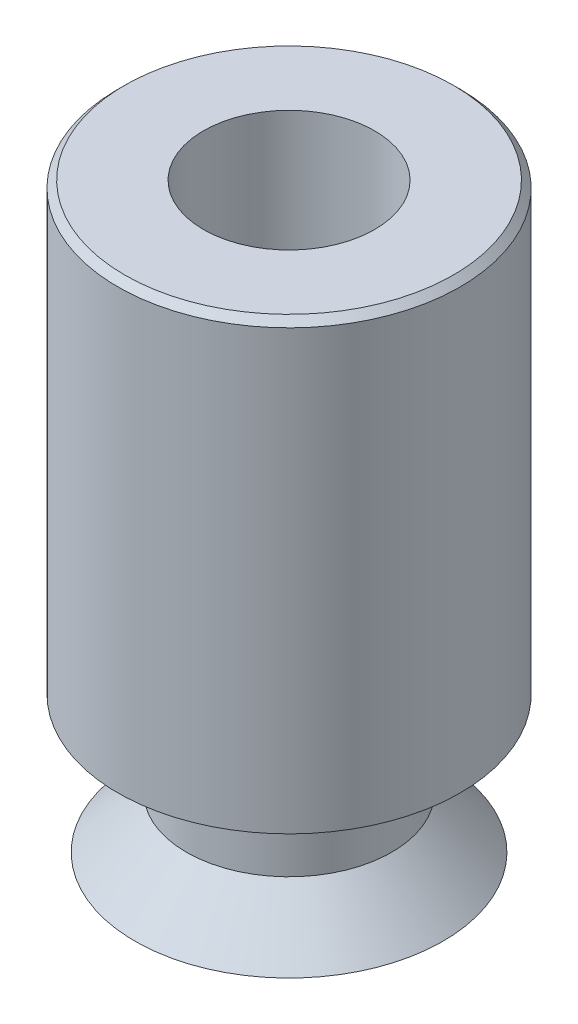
from build123d import *

# Parameters (mm, degrees)
TROU_TARAUD_M6X1_01_D     = 5
TROU_TARAUD_M6X1_01_DEPTH = 13
TROU_TARAUD_M6X1_01_TIP   = 1.443375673
CHANFREIN1_SIZE           = 0.2


with BuildPart() as part:
    # Esquisse1 → R_volution1 (revolve)
    with BuildSketch(Plane.XY, mode=Mode.PRIVATE) as r_volution1_sk:
        Polygon((0, 17), (-5, 17), (-5, 4), (-3, 4), (-3, 1.5), (-4.5, 0), (0, 0), align=None)
    revolve(r_volution1_sk.sketch.rotate(Axis((0, 0, 0), (0, 1, 0)), 270), axis=Axis((0, 0, 0), (0, 1, 0)))

    # Trou taraud_ M6x1.01
    with Locations(Plane(origin=(0, 17, 0), x_dir=(-1, 0, 0), z_dir=(0, 1, 0))):
        with Locations((0, 0)):
            Hole(TROU_TARAUD_M6X1_01_D / 2, depth=TROU_TARAUD_M6X1_01_DEPTH)
            with Locations((0, 0, -(TROU_TARAUD_M6X1_01_DEPTH + TROU_TARAUD_M6X1_01_TIP / 2))):  # 120° drill point
                Cone(0, TROU_TARAUD_M6X1_01_D / 2, TROU_TARAUD_M6X1_01_TIP, mode=Mode.SUBTRACT)

    # Chanfrein1
    chanfrein1_edges = [part.edges().sort_by_distance(p)[0] for p in [
        (0, 17, 5),
    ]]
    chamfer(chanfrein1_edges, length=CHANFREIN1_SIZE)


solid = part.part
